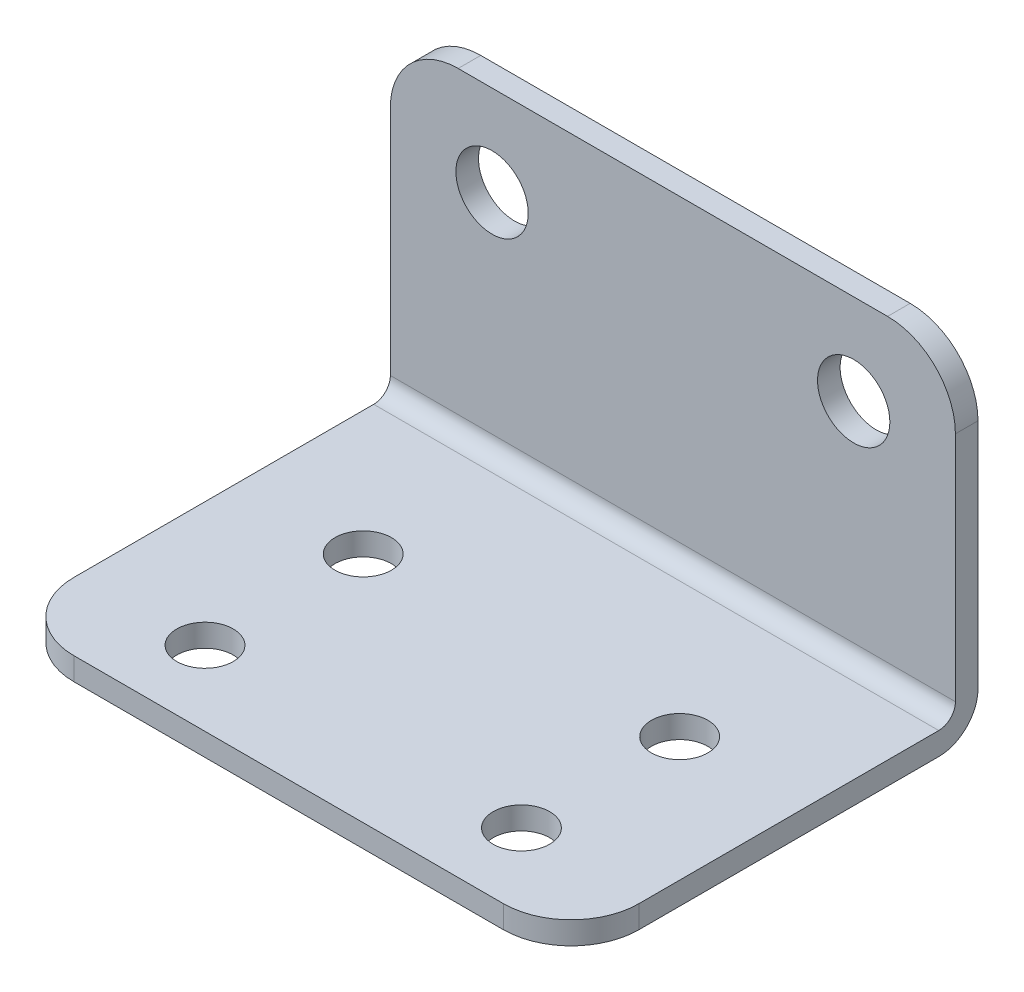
ISO-10303-21;
HEADER;
FILE_DESCRIPTION(('STEP AP214'),'2;1');
FILE_NAME('part.step','',(''),(''),'','','');
FILE_SCHEMA(('AUTOMOTIVE_DESIGN { 1 0 10303 214 1 1 1 1 }'));
ENDSEC;
DATA;
#1=APPLICATION_CONTEXT('core data for automotive mechanical design processes');
#2=APPLICATION_PROTOCOL_DEFINITION('international standard','automotive_design',2000,#1);
#3=PRODUCT_CONTEXT('',#1,'mechanical');
#4=PRODUCT('Part','Part','',(#3));
#5=PRODUCT_RELATED_PRODUCT_CATEGORY('part','',(#4));
#6=PRODUCT_DEFINITION_FORMATION('','',#4);
#7=PRODUCT_DEFINITION_CONTEXT('part definition',#1,'design');
#8=PRODUCT_DEFINITION('design','',#6,#7);
#9=PRODUCT_DEFINITION_SHAPE('','',#8);
#10=(LENGTH_UNIT() NAMED_UNIT(*) SI_UNIT(.MILLI.,.METRE.));
#11=(NAMED_UNIT(*) PLANE_ANGLE_UNIT() SI_UNIT($,.RADIAN.));
#12=(NAMED_UNIT(*) SI_UNIT($,.STERADIAN.) SOLID_ANGLE_UNIT());
#13=UNCERTAINTY_MEASURE_WITH_UNIT(LENGTH_MEASURE(1.E-05),#10,'distance_accuracy_value','');
#14=(GEOMETRIC_REPRESENTATION_CONTEXT(3) GLOBAL_UNCERTAINTY_ASSIGNED_CONTEXT((#13)) GLOBAL_UNIT_ASSIGNED_CONTEXT((#10,
#11,#12)) REPRESENTATION_CONTEXT('',''));
#15=CARTESIAN_POINT('',(0.,0.,0.));
#16=DIRECTION('',(0.,0.,1.));
#17=DIRECTION('',(1.,0.,0.));
#18=AXIS2_PLACEMENT_3D('',#15,#16,#17);
#19=CARTESIAN_POINT('',(0.,0.,0.));
#20=DIRECTION('',(0.,0.,-1.));
#21=DIRECTION('',(-1.,0.,0.));
#22=AXIS2_PLACEMENT_3D('',#19,#20,#21);
#23=PLANE('',#22);
#24=CARTESIAN_POINT('',(3.,12.,0.));
#25=DIRECTION('',(0.,0.,1.));
#26=DIRECTION('',(1.,0.,0.));
#27=AXIS2_PLACEMENT_3D('',#24,#25,#26);
#28=CIRCLE('',#27,3.);
#29=CARTESIAN_POINT('',(0.,12.,0.));
#30=VERTEX_POINT('',#29);
#31=CARTESIAN_POINT('',(3.,15.,0.));
#32=VERTEX_POINT('',#31);
#33=EDGE_CURVE('E110',#30,#32,#28,.F.);
#34=ORIENTED_EDGE('',*,*,#33,.F.);
#35=DIRECTION('',(0.,1.,0.));
#36=VECTOR('',#35,1.);
#37=CARTESIAN_POINT('',(0.,0.,0.));
#38=LINE('',#37,#36);
#39=CARTESIAN_POINT('',(0.,1.7366,0.));
#40=VERTEX_POINT('',#39);
#41=EDGE_CURVE('E104',#40,#30,#38,.T.);
#42=ORIENTED_EDGE('',*,*,#41,.F.);
#43=DIRECTION('',(1.,0.,0.));
#44=VECTOR('',#43,1.);
#45=CARTESIAN_POINT('',(25.,1.7366,0.));
#46=LINE('',#45,#44);
#47=CARTESIAN_POINT('',(25.,1.7366,0.));
#48=VERTEX_POINT('',#47);
#49=EDGE_CURVE('E232',#40,#48,#46,.T.);
#50=ORIENTED_EDGE('',*,*,#49,.T.);
#51=DIRECTION('',(0.,1.,0.));
#52=VECTOR('',#51,1.);
#53=CARTESIAN_POINT('',(25.,0.,0.));
#54=LINE('',#53,#52);
#55=CARTESIAN_POINT('',(25.,12.,0.));
#56=VERTEX_POINT('',#55);
#57=EDGE_CURVE('E143',#56,#48,#54,.F.);
#58=ORIENTED_EDGE('',*,*,#57,.F.);
#59=CARTESIAN_POINT('',(22.,12.,0.));
#60=DIRECTION('',(0.,0.,1.));
#61=DIRECTION('',(1.,0.,0.));
#62=AXIS2_PLACEMENT_3D('',#59,#60,#61);
#63=CIRCLE('',#62,3.);
#64=CARTESIAN_POINT('',(22.,15.,0.));
#65=VERTEX_POINT('',#64);
#66=EDGE_CURVE('E132',#65,#56,#63,.F.);
#67=ORIENTED_EDGE('',*,*,#66,.F.);
#68=DIRECTION('',(1.,0.,0.));
#69=VECTOR('',#68,1.);
#70=CARTESIAN_POINT('',(0.,15.,0.));
#71=LINE('',#70,#69);
#72=EDGE_CURVE('E124',#32,#65,#71,.T.);
#73=ORIENTED_EDGE('',*,*,#72,.F.);
#74=EDGE_LOOP('',(#34,#42,#50,#58,#67,#73));
#75=FACE_BOUND('',#74,.T.);
#76=CARTESIAN_POINT('',(20.5,11.,0.));
#77=DIRECTION('',(0.,0.,1.));
#78=DIRECTION('',(1.,0.,0.));
#79=AXIS2_PLACEMENT_3D('',#76,#77,#78);
#80=CIRCLE('',#79,1.59999999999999);
#81=CARTESIAN_POINT('',(22.1,11.,0.));
#82=VERTEX_POINT('',#81);
#83=EDGE_CURVE('E147',#82,#82,#80,.F.);
#84=ORIENTED_EDGE('',*,*,#83,.T.);
#85=EDGE_LOOP('',(#84));
#86=FACE_BOUND('',#85,.T.);
#87=CARTESIAN_POINT('',(4.5,11.,0.));
#88=DIRECTION('',(0.,0.,1.));
#89=DIRECTION('',(1.,0.,0.));
#90=AXIS2_PLACEMENT_3D('',#87,#88,#89);
#91=CIRCLE('',#90,1.59999999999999);
#92=CARTESIAN_POINT('',(6.1,11.,0.));
#93=VERTEX_POINT('',#92);
#94=EDGE_CURVE('E20',#93,#93,#91,.F.);
#95=ORIENTED_EDGE('',*,*,#94,.T.);
#96=EDGE_LOOP('',(#95));
#97=FACE_BOUND('',#96,.T.);
#98=ADVANCED_FACE('F17',(#75,#86,#97),#23,.F.);
#99=CARTESIAN_POINT('',(4.5,11.,0.));
#100=DIRECTION('',(0.,0.,1.));
#101=DIRECTION('',(1.,0.,0.));
#102=AXIS2_PLACEMENT_3D('',#99,#100,#101);
#103=CYLINDRICAL_SURFACE('',#102,1.59999999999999);
#104=CARTESIAN_POINT('',(4.5,11.,-1.));
#105=DIRECTION('',(0.,0.,1.));
#106=DIRECTION('',(1.,0.,0.));
#107=AXIS2_PLACEMENT_3D('',#104,#105,#106);
#108=CIRCLE('',#107,1.59999999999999);
#109=CARTESIAN_POINT('',(6.1,11.,-1.));
#110=VERTEX_POINT('',#109);
#111=EDGE_CURVE('E228',#110,#110,#108,.T.);
#112=ORIENTED_EDGE('',*,*,#111,.F.);
#113=EDGE_LOOP('',(#112));
#114=FACE_BOUND('',#113,.T.);
#115=ORIENTED_EDGE('',*,*,#94,.F.);
#116=EDGE_LOOP('',(#115));
#117=FACE_BOUND('',#116,.T.);
#118=ADVANCED_FACE('F244',(#114,#117),#103,.F.);
#119=CARTESIAN_POINT('',(20.5,11.,0.));
#120=DIRECTION('',(0.,0.,1.));
#121=DIRECTION('',(1.,0.,0.));
#122=AXIS2_PLACEMENT_3D('',#119,#120,#121);
#123=CYLINDRICAL_SURFACE('',#122,1.59999999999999);
#124=CARTESIAN_POINT('',(20.5,11.,-1.));
#125=DIRECTION('',(0.,0.,1.));
#126=DIRECTION('',(1.,0.,0.));
#127=AXIS2_PLACEMENT_3D('',#124,#125,#126);
#128=CIRCLE('',#127,1.59999999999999);
#129=CARTESIAN_POINT('',(22.1,11.,-1.));
#130=VERTEX_POINT('',#129);
#131=EDGE_CURVE('E224',#130,#130,#128,.T.);
#132=ORIENTED_EDGE('',*,*,#131,.F.);
#133=EDGE_LOOP('',(#132));
#134=FACE_BOUND('',#133,.T.);
#135=ORIENTED_EDGE('',*,*,#83,.F.);
#136=EDGE_LOOP('',(#135));
#137=FACE_BOUND('',#136,.T.);
#138=ADVANCED_FACE('F246',(#134,#137),#123,.F.);
#139=CARTESIAN_POINT('',(3.,12.,-1.));
#140=DIRECTION('',(0.,0.,1.));
#141=DIRECTION('',(1.,0.,0.));
#142=AXIS2_PLACEMENT_3D('',#139,#140,#141);
#143=CYLINDRICAL_SURFACE('',#142,3.);
#144=ORIENTED_EDGE('',*,*,#33,.T.);
#145=DIRECTION('',(0.,0.,1.));
#146=VECTOR('',#145,1.);
#147=CARTESIAN_POINT('',(3.,15.,-1.));
#148=LINE('',#147,#146);
#149=CARTESIAN_POINT('',(3.,15.,-1.));
#150=VERTEX_POINT('',#149);
#151=EDGE_CURVE('E114',#150,#32,#148,.T.);
#152=ORIENTED_EDGE('',*,*,#151,.F.);
#153=CARTESIAN_POINT('',(3.,12.,-1.));
#154=DIRECTION('',(0.,0.,1.));
#155=DIRECTION('',(1.,0.,0.));
#156=AXIS2_PLACEMENT_3D('',#153,#154,#155);
#157=CIRCLE('',#156,3.);
#158=CARTESIAN_POINT('',(0.,12.,-1.));
#159=VERTEX_POINT('',#158);
#160=EDGE_CURVE('E220',#159,#150,#157,.F.);
#161=ORIENTED_EDGE('',*,*,#160,.F.);
#162=DIRECTION('',(0.,0.,1.));
#163=VECTOR('',#162,1.);
#164=CARTESIAN_POINT('',(0.,12.,-1.));
#165=LINE('',#164,#163);
#166=EDGE_CURVE('E116',#159,#30,#165,.T.);
#167=ORIENTED_EDGE('',*,*,#166,.T.);
#168=EDGE_LOOP('',(#144,#152,#161,#167));
#169=FACE_BOUND('',#168,.T.);
#170=ADVANCED_FACE('F112',(#169),#143,.T.);
#171=CARTESIAN_POINT('',(0.,15.,-1.));
#172=DIRECTION('',(0.,1.,0.));
#173=DIRECTION('',(0.,0.,1.));
#174=AXIS2_PLACEMENT_3D('',#171,#172,#173);
#175=PLANE('',#174);
#176=ORIENTED_EDGE('',*,*,#72,.T.);
#177=DIRECTION('',(0.,0.,1.));
#178=VECTOR('',#177,1.);
#179=CARTESIAN_POINT('',(22.,15.,-1.));
#180=LINE('',#179,#178);
#181=CARTESIAN_POINT('',(22.,15.,-1.));
#182=VERTEX_POINT('',#181);
#183=EDGE_CURVE('E134',#182,#65,#180,.T.);
#184=ORIENTED_EDGE('',*,*,#183,.F.);
#185=DIRECTION('',(-1.,0.,0.));
#186=VECTOR('',#185,1.);
#187=CARTESIAN_POINT('',(0.,15.,-1.));
#188=LINE('',#187,#186);
#189=EDGE_CURVE('E126',#150,#182,#188,.F.);
#190=ORIENTED_EDGE('',*,*,#189,.F.);
#191=ORIENTED_EDGE('',*,*,#151,.T.);
#192=EDGE_LOOP('',(#176,#184,#190,#191));
#193=FACE_BOUND('',#192,.T.);
#194=ADVANCED_FACE('F122',(#193),#175,.T.);
#195=CARTESIAN_POINT('',(22.,12.,-1.));
#196=DIRECTION('',(0.,0.,1.));
#197=DIRECTION('',(1.,0.,0.));
#198=AXIS2_PLACEMENT_3D('',#195,#196,#197);
#199=CYLINDRICAL_SURFACE('',#198,3.);
#200=ORIENTED_EDGE('',*,*,#66,.T.);
#201=DIRECTION('',(0.,0.,-1.));
#202=VECTOR('',#201,1.);
#203=CARTESIAN_POINT('',(25.,12.,-1.));
#204=LINE('',#203,#202);
#205=CARTESIAN_POINT('',(25.,12.,-1.));
#206=VERTEX_POINT('',#205);
#207=EDGE_CURVE('E234',#206,#56,#204,.F.);
#208=ORIENTED_EDGE('',*,*,#207,.F.);
#209=CARTESIAN_POINT('',(22.,12.,-1.));
#210=DIRECTION('',(0.,0.,1.));
#211=DIRECTION('',(1.,0.,0.));
#212=AXIS2_PLACEMENT_3D('',#209,#210,#211);
#213=CIRCLE('',#212,3.);
#214=EDGE_CURVE('E217',#182,#206,#213,.F.);
#215=ORIENTED_EDGE('',*,*,#214,.F.);
#216=ORIENTED_EDGE('',*,*,#183,.T.);
#217=EDGE_LOOP('',(#200,#208,#215,#216));
#218=FACE_BOUND('',#217,.T.);
#219=ADVANCED_FACE('F314',(#218),#199,.T.);
#220=CARTESIAN_POINT('',(25.,1.7366,0.7366));
#221=DIRECTION('',(1.,0.,0.));
#222=DIRECTION('',(0.,0.,-1.));
#223=AXIS2_PLACEMENT_3D('',#220,#221,#222);
#224=CYLINDRICAL_SURFACE('',#223,0.7366);
#225=CARTESIAN_POINT('',(0.,1.7366,0.7366));
#226=DIRECTION('',(1.,0.,0.));
#227=DIRECTION('',(0.,0.,-1.));
#228=AXIS2_PLACEMENT_3D('',#225,#226,#227);
#229=CIRCLE('',#228,0.7366);
#230=CARTESIAN_POINT('',(0.,0.999999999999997,0.736599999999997));
#231=VERTEX_POINT('',#230);
#232=EDGE_CURVE('E209',#231,#40,#229,.T.);
#233=ORIENTED_EDGE('',*,*,#232,.F.);
#234=DIRECTION('',(1.,0.,0.));
#235=VECTOR('',#234,1.);
#236=CARTESIAN_POINT('',(0.,0.999999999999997,0.736599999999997));
#237=LINE('',#236,#235);
#238=CARTESIAN_POINT('',(25.,0.999999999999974,0.736599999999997));
#239=VERTEX_POINT('',#238);
#240=EDGE_CURVE('E208',#239,#231,#237,.F.);
#241=ORIENTED_EDGE('',*,*,#240,.F.);
#242=CARTESIAN_POINT('',(25.,1.7366,0.7366));
#243=DIRECTION('',(1.,0.,0.));
#244=DIRECTION('',(0.,0.,-1.));
#245=AXIS2_PLACEMENT_3D('',#242,#243,#244);
#246=CIRCLE('',#245,0.7366);
#247=EDGE_CURVE('E212',#239,#48,#246,.T.);
#248=ORIENTED_EDGE('',*,*,#247,.T.);
#249=ORIENTED_EDGE('',*,*,#49,.F.);
#250=EDGE_LOOP('',(#233,#241,#248,#249));
#251=FACE_BOUND('',#250,.T.);
#252=ADVANCED_FACE('F310',(#251),#224,.F.);
#253=CARTESIAN_POINT('',(0.,0.,-1.));
#254=DIRECTION('',(0.,0.,-1.));
#255=DIRECTION('',(-1.,0.,0.));
#256=AXIS2_PLACEMENT_3D('',#253,#254,#255);
#257=PLANE('',#256);
#258=DIRECTION('',(0.,1.,0.));
#259=VECTOR('',#258,1.);
#260=CARTESIAN_POINT('',(25.,0.,-1.));
#261=LINE('',#260,#259);
#262=CARTESIAN_POINT('',(25.,1.7366,-1.));
#263=VERTEX_POINT('',#262);
#264=EDGE_CURVE('E216',#206,#263,#261,.F.);
#265=ORIENTED_EDGE('',*,*,#264,.T.);
#266=DIRECTION('',(1.,0.,0.));
#267=VECTOR('',#266,1.);
#268=CARTESIAN_POINT('',(25.,1.7366,-1.));
#269=LINE('',#268,#267);
#270=CARTESIAN_POINT('',(0.,1.7366,-1.));
#271=VERTEX_POINT('',#270);
#272=EDGE_CURVE('E191',#271,#263,#269,.T.);
#273=ORIENTED_EDGE('',*,*,#272,.F.);
#274=DIRECTION('',(0.,1.,0.));
#275=VECTOR('',#274,1.);
#276=CARTESIAN_POINT('',(0.,0.,-1.));
#277=LINE('',#276,#275);
#278=EDGE_CURVE('E223',#271,#159,#277,.T.);
#279=ORIENTED_EDGE('',*,*,#278,.T.);
#280=ORIENTED_EDGE('',*,*,#160,.T.);
#281=ORIENTED_EDGE('',*,*,#189,.T.);
#282=ORIENTED_EDGE('',*,*,#214,.T.);
#283=EDGE_LOOP('',(#265,#273,#279,#280,#281,#282));
#284=FACE_BOUND('',#283,.T.);
#285=ORIENTED_EDGE('',*,*,#131,.T.);
#286=EDGE_LOOP('',(#285));
#287=FACE_BOUND('',#286,.T.);
#288=ORIENTED_EDGE('',*,*,#111,.T.);
#289=EDGE_LOOP('',(#288));
#290=FACE_BOUND('',#289,.T.);
#291=ADVANCED_FACE('F306',(#284,#287,#290),#257,.T.);
#292=CARTESIAN_POINT('',(0.,1.,0.));
#293=DIRECTION('',(0.,1.,0.));
#294=DIRECTION('',(0.,0.,1.));
#295=AXIS2_PLACEMENT_3D('',#292,#293,#294);
#296=PLANE('',#295);
#297=DIRECTION('',(0.,0.,-1.));
#298=VECTOR('',#297,1.);
#299=CARTESIAN_POINT('',(0.,0.999999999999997,0.));
#300=LINE('',#299,#298);
#301=CARTESIAN_POINT('',(0.,0.999999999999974,14.));
#302=VERTEX_POINT('',#301);
#303=EDGE_CURVE('E183',#231,#302,#300,.F.);
#304=ORIENTED_EDGE('',*,*,#303,.T.);
#305=CARTESIAN_POINT('',(3.,0.999999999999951,14.));
#306=DIRECTION('',(0.,1.,0.));
#307=DIRECTION('',(0.,0.,1.));
#308=AXIS2_PLACEMENT_3D('',#305,#306,#307);
#309=CIRCLE('',#308,3.);
#310=CARTESIAN_POINT('',(3.,0.999999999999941,17.));
#311=VERTEX_POINT('',#310);
#312=EDGE_CURVE('E180',#311,#302,#309,.F.);
#313=ORIENTED_EDGE('',*,*,#312,.F.);
#314=DIRECTION('',(1.,0.,0.));
#315=VECTOR('',#314,1.);
#316=CARTESIAN_POINT('',(0.,0.999999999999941,17.));
#317=LINE('',#316,#315);
#318=CARTESIAN_POINT('',(22.,0.999999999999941,17.));
#319=VERTEX_POINT('',#318);
#320=EDGE_CURVE('E179',#311,#319,#317,.T.);
#321=ORIENTED_EDGE('',*,*,#320,.T.);
#322=CARTESIAN_POINT('',(22.,0.999999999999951,14.));
#323=DIRECTION('',(0.,1.,0.));
#324=DIRECTION('',(0.,0.,1.));
#325=AXIS2_PLACEMENT_3D('',#322,#323,#324);
#326=CIRCLE('',#325,3.);
#327=CARTESIAN_POINT('',(25.,0.999999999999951,14.));
#328=VERTEX_POINT('',#327);
#329=EDGE_CURVE('E175',#328,#319,#326,.F.);
#330=ORIENTED_EDGE('',*,*,#329,.F.);
#331=DIRECTION('',(0.,0.,1.));
#332=VECTOR('',#331,1.);
#333=CARTESIAN_POINT('',(25.,0.999999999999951,17.));
#334=LINE('',#333,#332);
#335=EDGE_CURVE('E174',#328,#239,#334,.F.);
#336=ORIENTED_EDGE('',*,*,#335,.T.);
#337=ORIENTED_EDGE('',*,*,#240,.T.);
#338=EDGE_LOOP('',(#304,#313,#321,#330,#336,#337));
#339=FACE_BOUND('',#338,.T.);
#340=CARTESIAN_POINT('',(19.5,0.999999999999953,13.7));
#341=DIRECTION('',(0.,1.,0.));
#342=DIRECTION('',(0.,0.,1.));
#343=AXIS2_PLACEMENT_3D('',#340,#341,#342);
#344=CIRCLE('',#343,1.24999999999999);
#345=CARTESIAN_POINT('',(19.5,0.999999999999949,14.95));
#346=VERTEX_POINT('',#345);
#347=EDGE_CURVE('E192',#346,#346,#344,.F.);
#348=ORIENTED_EDGE('',*,*,#347,.T.);
#349=EDGE_LOOP('',(#348));
#350=FACE_BOUND('',#349,.T.);
#351=CARTESIAN_POINT('',(19.5,0.999999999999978,6.7));
#352=DIRECTION('',(0.,1.,0.));
#353=DIRECTION('',(0.,0.,1.));
#354=AXIS2_PLACEMENT_3D('',#351,#352,#353);
#355=CIRCLE('',#354,1.24999999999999);
#356=CARTESIAN_POINT('',(19.5,0.999999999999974,7.94999999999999));
#357=VERTEX_POINT('',#356);
#358=EDGE_CURVE('E196',#357,#357,#355,.F.);
#359=ORIENTED_EDGE('',*,*,#358,.T.);
#360=EDGE_LOOP('',(#359));
#361=FACE_BOUND('',#360,.T.);
#362=CARTESIAN_POINT('',(5.5,0.999999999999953,13.7));
#363=DIRECTION('',(0.,1.,0.));
#364=DIRECTION('',(0.,0.,1.));
#365=AXIS2_PLACEMENT_3D('',#362,#363,#364);
#366=CIRCLE('',#365,1.24999999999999);
#367=CARTESIAN_POINT('',(5.5,0.999999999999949,14.95));
#368=VERTEX_POINT('',#367);
#369=EDGE_CURVE('E200',#368,#368,#366,.F.);
#370=ORIENTED_EDGE('',*,*,#369,.T.);
#371=EDGE_LOOP('',(#370));
#372=FACE_BOUND('',#371,.T.);
#373=CARTESIAN_POINT('',(5.5,0.999999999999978,6.7));
#374=DIRECTION('',(0.,1.,0.));
#375=DIRECTION('',(0.,0.,1.));
#376=AXIS2_PLACEMENT_3D('',#373,#374,#375);
#377=CIRCLE('',#376,1.24999999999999);
#378=CARTESIAN_POINT('',(5.5,0.999999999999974,7.94999999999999));
#379=VERTEX_POINT('',#378);
#380=EDGE_CURVE('E204',#379,#379,#377,.F.);
#381=ORIENTED_EDGE('',*,*,#380,.T.);
#382=EDGE_LOOP('',(#381));
#383=FACE_BOUND('',#382,.T.);
#384=ADVANCED_FACE('F302',(#339,#350,#361,#372,#383),#296,.T.);
#385=CARTESIAN_POINT('',(5.5,0.999999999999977,6.7));
#386=DIRECTION('',(0.,1.,0.));
#387=DIRECTION('',(0.,0.,1.));
#388=AXIS2_PLACEMENT_3D('',#385,#386,#387);
#389=CYLINDRICAL_SURFACE('',#388,1.24999999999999);
#390=CARTESIAN_POINT('',(5.5,0.,6.7));
#391=DIRECTION('',(0.,1.,0.));
#392=DIRECTION('',(0.,0.,1.));
#393=AXIS2_PLACEMENT_3D('',#390,#391,#392);
#394=CIRCLE('',#393,1.24999999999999);
#395=CARTESIAN_POINT('',(5.5,0.,7.94999999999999));
#396=VERTEX_POINT('',#395);
#397=EDGE_CURVE('E170',#396,#396,#394,.F.);
#398=ORIENTED_EDGE('',*,*,#397,.T.);
#399=EDGE_LOOP('',(#398));
#400=FACE_BOUND('',#399,.T.);
#401=ORIENTED_EDGE('',*,*,#380,.F.);
#402=EDGE_LOOP('',(#401));
#403=FACE_BOUND('',#402,.T.);
#404=ADVANCED_FACE('F298',(#400,#403),#389,.F.);
#405=CARTESIAN_POINT('',(5.5,0.999999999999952,13.7));
#406=DIRECTION('',(0.,1.,0.));
#407=DIRECTION('',(0.,0.,1.));
#408=AXIS2_PLACEMENT_3D('',#405,#406,#407);
#409=CYLINDRICAL_SURFACE('',#408,1.24999999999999);
#410=CARTESIAN_POINT('',(5.5,-1.11239142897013E-13,13.7));
#411=DIRECTION('',(0.,1.,0.));
#412=DIRECTION('',(0.,0.,1.));
#413=AXIS2_PLACEMENT_3D('',#410,#411,#412);
#414=CIRCLE('',#413,1.24999999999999);
#415=CARTESIAN_POINT('',(5.5,-1.15603494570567E-13,14.95));
#416=VERTEX_POINT('',#415);
#417=EDGE_CURVE('E166',#416,#416,#414,.F.);
#418=ORIENTED_EDGE('',*,*,#417,.T.);
#419=EDGE_LOOP('',(#418));
#420=FACE_BOUND('',#419,.T.);
#421=ORIENTED_EDGE('',*,*,#369,.F.);
#422=EDGE_LOOP('',(#421));
#423=FACE_BOUND('',#422,.T.);
#424=ADVANCED_FACE('F294',(#420,#423),#409,.F.);
#425=CARTESIAN_POINT('',(19.5,0.999999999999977,6.7));
#426=DIRECTION('',(0.,1.,0.));
#427=DIRECTION('',(0.,0.,1.));
#428=AXIS2_PLACEMENT_3D('',#425,#426,#427);
#429=CYLINDRICAL_SURFACE('',#428,1.24999999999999);
#430=CARTESIAN_POINT('',(19.5,0.,6.7));
#431=DIRECTION('',(0.,1.,0.));
#432=DIRECTION('',(0.,0.,1.));
#433=AXIS2_PLACEMENT_3D('',#430,#431,#432);
#434=CIRCLE('',#433,1.24999999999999);
#435=CARTESIAN_POINT('',(19.5,0.,7.94999999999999));
#436=VERTEX_POINT('',#435);
#437=EDGE_CURVE('E162',#436,#436,#434,.F.);
#438=ORIENTED_EDGE('',*,*,#437,.T.);
#439=EDGE_LOOP('',(#438));
#440=FACE_BOUND('',#439,.T.);
#441=ORIENTED_EDGE('',*,*,#358,.F.);
#442=EDGE_LOOP('',(#441));
#443=FACE_BOUND('',#442,.T.);
#444=ADVANCED_FACE('F290',(#440,#443),#429,.F.);
#445=CARTESIAN_POINT('',(19.5,0.999999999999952,13.7));
#446=DIRECTION('',(0.,1.,0.));
#447=DIRECTION('',(0.,0.,1.));
#448=AXIS2_PLACEMENT_3D('',#445,#446,#447);
#449=CYLINDRICAL_SURFACE('',#448,1.24999999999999);
#450=CARTESIAN_POINT('',(19.5,-1.11239142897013E-13,13.7));
#451=DIRECTION('',(0.,1.,0.));
#452=DIRECTION('',(0.,0.,1.));
#453=AXIS2_PLACEMENT_3D('',#450,#451,#452);
#454=CIRCLE('',#453,1.24999999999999);
#455=CARTESIAN_POINT('',(19.5,-1.15603494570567E-13,14.95));
#456=VERTEX_POINT('',#455);
#457=EDGE_CURVE('E157',#456,#456,#454,.F.);
#458=ORIENTED_EDGE('',*,*,#457,.T.);
#459=EDGE_LOOP('',(#458));
#460=FACE_BOUND('',#459,.T.);
#461=ORIENTED_EDGE('',*,*,#347,.F.);
#462=EDGE_LOOP('',(#461));
#463=FACE_BOUND('',#462,.T.);
#464=ADVANCED_FACE('F286',(#460,#463),#449,.F.);
#465=CARTESIAN_POINT('',(25.,1.7366,0.7366));
#466=DIRECTION('',(1.,0.,0.));
#467=DIRECTION('',(0.,0.,-1.));
#468=AXIS2_PLACEMENT_3D('',#465,#466,#467);
#469=CYLINDRICAL_SURFACE('',#468,1.7366);
#470=DIRECTION('',(1.,0.,0.));
#471=VECTOR('',#470,1.);
#472=CARTESIAN_POINT('',(0.,0.,0.736599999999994));
#473=LINE('',#472,#471);
#474=CARTESIAN_POINT('',(25.,0.,0.736599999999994));
#475=VERTEX_POINT('',#474);
#476=CARTESIAN_POINT('',(0.,0.,0.736599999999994));
#477=VERTEX_POINT('',#476);
#478=EDGE_CURVE('E161',#475,#477,#473,.F.);
#479=ORIENTED_EDGE('',*,*,#478,.T.);
#480=CARTESIAN_POINT('',(0.,1.7366,0.7366));
#481=DIRECTION('',(1.,0.,0.));
#482=DIRECTION('',(0.,0.,-1.));
#483=AXIS2_PLACEMENT_3D('',#480,#481,#482);
#484=CIRCLE('',#483,1.7366);
#485=EDGE_CURVE('E184',#477,#271,#484,.T.);
#486=ORIENTED_EDGE('',*,*,#485,.T.);
#487=ORIENTED_EDGE('',*,*,#272,.T.);
#488=CARTESIAN_POINT('',(25.,1.7366,0.7366));
#489=DIRECTION('',(1.,0.,0.));
#490=DIRECTION('',(0.,0.,-1.));
#491=AXIS2_PLACEMENT_3D('',#488,#489,#490);
#492=CIRCLE('',#491,1.7366);
#493=EDGE_CURVE('E188',#263,#475,#492,.F.);
#494=ORIENTED_EDGE('',*,*,#493,.T.);
#495=EDGE_LOOP('',(#479,#486,#487,#494));
#496=FACE_BOUND('',#495,.T.);
#497=ADVANCED_FACE('F283',(#496),#469,.T.);
#498=CARTESIAN_POINT('',(0.,0.,0.));
#499=DIRECTION('',(1.,0.,0.));
#500=DIRECTION('',(0.,0.,-1.));
#501=AXIS2_PLACEMENT_3D('',#498,#499,#500);
#502=PLANE('',#501);
#503=DIRECTION('',(0.,1.,0.));
#504=VECTOR('',#503,1.);
#505=CARTESIAN_POINT('',(0.,0.,14.));
#506=LINE('',#505,#504);
#507=CARTESIAN_POINT('',(0.,0.,14.));
#508=VERTEX_POINT('',#507);
#509=EDGE_CURVE('E182',#302,#508,#506,.F.);
#510=ORIENTED_EDGE('',*,*,#509,.F.);
#511=ORIENTED_EDGE('',*,*,#303,.F.);
#512=ORIENTED_EDGE('',*,*,#232,.T.);
#513=ORIENTED_EDGE('',*,*,#41,.T.);
#514=ORIENTED_EDGE('',*,*,#166,.F.);
#515=ORIENTED_EDGE('',*,*,#278,.F.);
#516=ORIENTED_EDGE('',*,*,#485,.F.);
#517=DIRECTION('',(0.,0.,1.));
#518=VECTOR('',#517,1.);
#519=CARTESIAN_POINT('',(0.,0.,0.));
#520=LINE('',#519,#518);
#521=EDGE_CURVE('E156',#477,#508,#520,.T.);
#522=ORIENTED_EDGE('',*,*,#521,.T.);
#523=EDGE_LOOP('',(#510,#511,#512,#513,#514,#515,#516,#522));
#524=FACE_BOUND('',#523,.T.);
#525=ADVANCED_FACE('F279',(#524),#502,.F.);
#526=CARTESIAN_POINT('',(3.,0.,14.));
#527=DIRECTION('',(0.,1.,0.));
#528=DIRECTION('',(0.,0.,1.));
#529=AXIS2_PLACEMENT_3D('',#526,#527,#528);
#530=CYLINDRICAL_SURFACE('',#529,3.);
#531=ORIENTED_EDGE('',*,*,#312,.T.);
#532=ORIENTED_EDGE('',*,*,#509,.T.);
#533=CARTESIAN_POINT('',(3.,0.,14.));
#534=DIRECTION('',(0.,1.,0.));
#535=DIRECTION('',(0.,0.,1.));
#536=AXIS2_PLACEMENT_3D('',#533,#534,#535);
#537=CIRCLE('',#536,3.);
#538=CARTESIAN_POINT('',(3.,0.,17.));
#539=VERTEX_POINT('',#538);
#540=EDGE_CURVE('E152',#508,#539,#537,.T.);
#541=ORIENTED_EDGE('',*,*,#540,.T.);
#542=DIRECTION('',(0.,1.,0.));
#543=VECTOR('',#542,1.);
#544=CARTESIAN_POINT('',(3.,0.,17.));
#545=LINE('',#544,#543);
#546=EDGE_CURVE('E557',#539,#311,#545,.T.);
#547=ORIENTED_EDGE('',*,*,#546,.T.);
#548=EDGE_LOOP('',(#531,#532,#541,#547));
#549=FACE_BOUND('',#548,.T.);
#550=ADVANCED_FACE('F275',(#549),#530,.T.);
#551=CARTESIAN_POINT('',(0.,0.,17.));
#552=DIRECTION('',(0.,0.,-1.));
#553=DIRECTION('',(0.,1.,0.));
#554=AXIS2_PLACEMENT_3D('',#551,#552,#553);
#555=PLANE('',#554);
#556=DIRECTION('',(0.,1.,0.));
#557=VECTOR('',#556,1.);
#558=CARTESIAN_POINT('',(22.,0.,17.));
#559=LINE('',#558,#557);
#560=CARTESIAN_POINT('',(22.,0.,17.));
#561=VERTEX_POINT('',#560);
#562=EDGE_CURVE('E178',#319,#561,#559,.F.);
#563=ORIENTED_EDGE('',*,*,#562,.F.);
#564=ORIENTED_EDGE('',*,*,#320,.F.);
#565=ORIENTED_EDGE('',*,*,#546,.F.);
#566=DIRECTION('',(1.,0.,0.));
#567=VECTOR('',#566,1.);
#568=CARTESIAN_POINT('',(0.,0.,17.));
#569=LINE('',#568,#567);
#570=EDGE_CURVE('E151',#539,#561,#569,.T.);
#571=ORIENTED_EDGE('',*,*,#570,.T.);
#572=EDGE_LOOP('',(#563,#564,#565,#571));
#573=FACE_BOUND('',#572,.T.);
#574=ADVANCED_FACE('F271',(#573),#555,.F.);
#575=CARTESIAN_POINT('',(22.,0.,14.));
#576=DIRECTION('',(0.,1.,0.));
#577=DIRECTION('',(0.,0.,1.));
#578=AXIS2_PLACEMENT_3D('',#575,#576,#577);
#579=CYLINDRICAL_SURFACE('',#578,3.);
#580=ORIENTED_EDGE('',*,*,#329,.T.);
#581=ORIENTED_EDGE('',*,*,#562,.T.);
#582=CARTESIAN_POINT('',(22.,0.,14.));
#583=DIRECTION('',(0.,1.,0.));
#584=DIRECTION('',(0.,0.,1.));
#585=AXIS2_PLACEMENT_3D('',#582,#583,#584);
#586=CIRCLE('',#585,3.);
#587=CARTESIAN_POINT('',(25.,0.,14.));
#588=VERTEX_POINT('',#587);
#589=EDGE_CURVE('E27',#561,#588,#586,.T.);
#590=ORIENTED_EDGE('',*,*,#589,.T.);
#591=DIRECTION('',(0.,1.,0.));
#592=VECTOR('',#591,1.);
#593=CARTESIAN_POINT('',(25.,0.,14.));
#594=LINE('',#593,#592);
#595=EDGE_CURVE('E35',#588,#328,#594,.T.);
#596=ORIENTED_EDGE('',*,*,#595,.T.);
#597=EDGE_LOOP('',(#580,#581,#590,#596));
#598=FACE_BOUND('',#597,.T.);
#599=ADVANCED_FACE('F264',(#598),#579,.T.);
#600=CARTESIAN_POINT('',(25.,0.,17.));
#601=DIRECTION('',(-1.,0.,0.));
#602=DIRECTION('',(0.,0.,1.));
#603=AXIS2_PLACEMENT_3D('',#600,#601,#602);
#604=PLANE('',#603);
#605=ORIENTED_EDGE('',*,*,#595,.F.);
#606=DIRECTION('',(0.,0.,1.));
#607=VECTOR('',#606,1.);
#608=CARTESIAN_POINT('',(25.,0.,0.));
#609=LINE('',#608,#607);
#610=EDGE_CURVE('E11',#588,#475,#609,.F.);
#611=ORIENTED_EDGE('',*,*,#610,.T.);
#612=ORIENTED_EDGE('',*,*,#493,.F.);
#613=ORIENTED_EDGE('',*,*,#264,.F.);
#614=ORIENTED_EDGE('',*,*,#207,.T.);
#615=ORIENTED_EDGE('',*,*,#57,.T.);
#616=ORIENTED_EDGE('',*,*,#247,.F.);
#617=ORIENTED_EDGE('',*,*,#335,.F.);
#618=EDGE_LOOP('',(#605,#611,#612,#613,#614,#615,#616,#617));
#619=FACE_BOUND('',#618,.T.);
#620=ADVANCED_FACE('F258',(#619),#604,.F.);
#621=CARTESIAN_POINT('',(0.,0.,0.));
#622=DIRECTION('',(0.,1.,0.));
#623=DIRECTION('',(0.,0.,1.));
#624=AXIS2_PLACEMENT_3D('',#621,#622,#623);
#625=PLANE('',#624);
#626=ORIENTED_EDGE('',*,*,#589,.F.);
#627=ORIENTED_EDGE('',*,*,#570,.F.);
#628=ORIENTED_EDGE('',*,*,#540,.F.);
#629=ORIENTED_EDGE('',*,*,#521,.F.);
#630=ORIENTED_EDGE('',*,*,#478,.F.);
#631=ORIENTED_EDGE('',*,*,#610,.F.);
#632=EDGE_LOOP('',(#626,#627,#628,#629,#630,#631));
#633=FACE_BOUND('',#632,.T.);
#634=ORIENTED_EDGE('',*,*,#457,.F.);
#635=EDGE_LOOP('',(#634));
#636=FACE_BOUND('',#635,.T.);
#637=ORIENTED_EDGE('',*,*,#437,.F.);
#638=EDGE_LOOP('',(#637));
#639=FACE_BOUND('',#638,.T.);
#640=ORIENTED_EDGE('',*,*,#417,.F.);
#641=EDGE_LOOP('',(#640));
#642=FACE_BOUND('',#641,.T.);
#643=ORIENTED_EDGE('',*,*,#397,.F.);
#644=EDGE_LOOP('',(#643));
#645=FACE_BOUND('',#644,.T.);
#646=ADVANCED_FACE('F256',(#633,#636,#639,#642,#645),#625,.F.);
#647=CLOSED_SHELL('',(#98,#118,#138,#170,#194,#219,#252,#291,#384,#404,#424,#444,#464,#497,#525,
#550,#574,#599,#620,#646));
#648=MANIFOLD_SOLID_BREP('B1',#647);
#649=ADVANCED_BREP_SHAPE_REPRESENTATION('',(#18,#648),#14);
#650=SHAPE_DEFINITION_REPRESENTATION(#9,#649);
ENDSEC;
END-ISO-10303-21;
